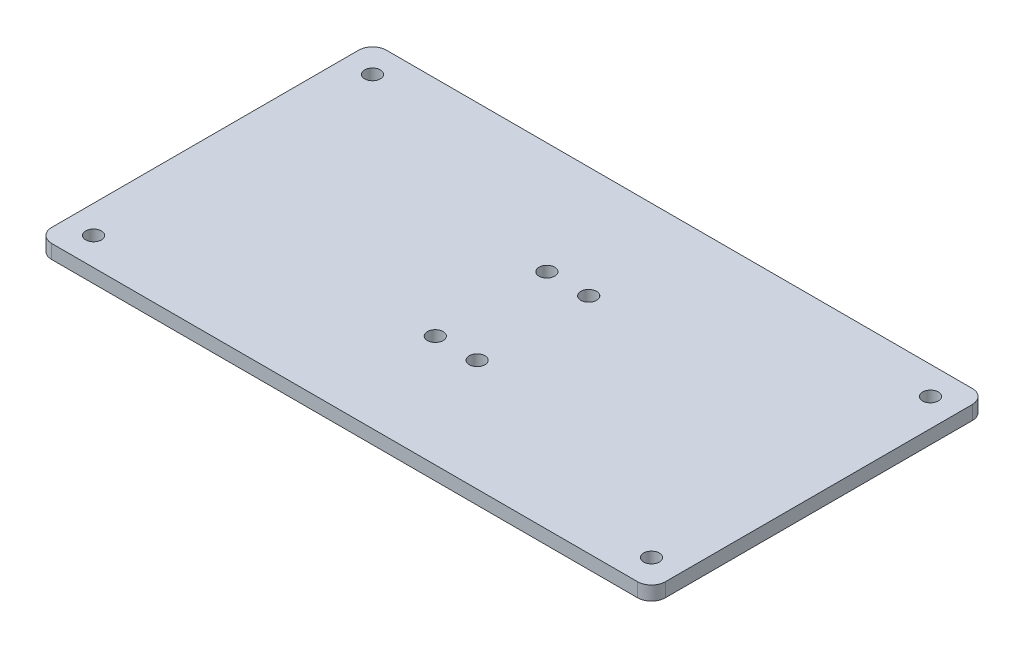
from build123d import *

# Parameters (mm, degrees)
SKETCH1_W           = 279.4
SKETCH1_H           = 152.4
SKETCH1_R           = 3.571875
BOSS_EXTRUDE1_DEPTH = 6.35
FILLET1_R           = 6.35


with BuildPart() as part:
    # Sketch1 → Boss-Extrude1 (new body)
    with BuildSketch(Plane(origin=(0, 0, 0), x_dir=(1, 0, 0), z_dir=(0, 1, 0))):
        Rectangle(SKETCH1_W, SKETCH1_H)
        with Locations(Location((9.525, 25.4, 0), (0, 0, 270))):
            Circle(SKETCH1_R, mode=Mode.SUBTRACT)
        with Locations(Location((-9.525, 25.4, 0), (0, 0, 270))):
            Circle(SKETCH1_R, mode=Mode.SUBTRACT)
        with Locations(Location((-9.525, -25.4, 0), (0, 0, 270))):
            Circle(SKETCH1_R, mode=Mode.SUBTRACT)
        with Locations(Location((9.525, -25.4, 0), (0, 0, 270))):
            Circle(SKETCH1_R, mode=Mode.SUBTRACT)
        with Locations(Location((-127, 63.5, 0), (0, 0, 270))):
            Circle(SKETCH1_R, mode=Mode.SUBTRACT)
        with Locations(Location((127, 63.5, 0), (0, 0, 270))):
            Circle(SKETCH1_R, mode=Mode.SUBTRACT)
        with Locations(Location((127, -63.5, 0), (0, 0, 270))):
            Circle(SKETCH1_R, mode=Mode.SUBTRACT)
        with Locations(Location((-127, -63.5, 0), (0, 0, 270))):
            Circle(SKETCH1_R, mode=Mode.SUBTRACT)
    extrude(amount=BOSS_EXTRUDE1_DEPTH)

    # Fillet1
    fillet1_edges = [part.edges().sort_by_distance(p)[0] for p in [
        (139.7, 3.175, 76.2),
        (-139.7, 3.175, 76.2),
        (-139.7, 3.175, -76.2),
        (139.7, 3.175, -76.2),
    ]]
    fillet(fillet1_edges, radius=FILLET1_R)


solid = part.part
